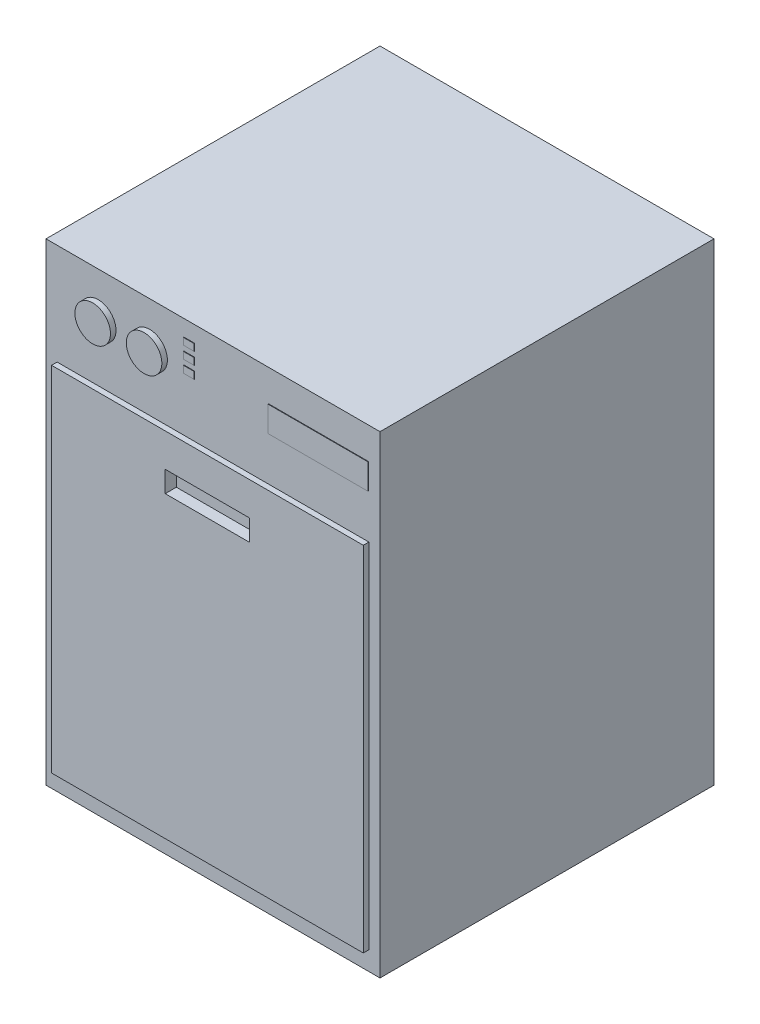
ISO-10303-21;
HEADER;
FILE_DESCRIPTION(('STEP AP214'),'2;1');
FILE_NAME('part.step','',(''),(''),'','','');
FILE_SCHEMA(('AUTOMOTIVE_DESIGN { 1 0 10303 214 1 1 1 1 }'));
ENDSEC;
DATA;
#1=APPLICATION_CONTEXT('core data for automotive mechanical design processes');
#2=APPLICATION_PROTOCOL_DEFINITION('international standard','automotive_design',2000,#1);
#3=PRODUCT_CONTEXT('',#1,'mechanical');
#4=PRODUCT('Part','Part','',(#3));
#5=PRODUCT_RELATED_PRODUCT_CATEGORY('part','',(#4));
#6=PRODUCT_DEFINITION_FORMATION('','',#4);
#7=PRODUCT_DEFINITION_CONTEXT('part definition',#1,'design');
#8=PRODUCT_DEFINITION('design','',#6,#7);
#9=PRODUCT_DEFINITION_SHAPE('','',#8);
#10=(LENGTH_UNIT() NAMED_UNIT(*) SI_UNIT(.MILLI.,.METRE.));
#11=(NAMED_UNIT(*) PLANE_ANGLE_UNIT() SI_UNIT($,.RADIAN.));
#12=(NAMED_UNIT(*) SI_UNIT($,.STERADIAN.) SOLID_ANGLE_UNIT());
#13=UNCERTAINTY_MEASURE_WITH_UNIT(LENGTH_MEASURE(1.E-05),#10,'distance_accuracy_value','');
#14=(GEOMETRIC_REPRESENTATION_CONTEXT(3) GLOBAL_UNCERTAINTY_ASSIGNED_CONTEXT((#13)) GLOBAL_UNIT_ASSIGNED_CONTEXT((#10,
#11,#12)) REPRESENTATION_CONTEXT('',''));
#15=CARTESIAN_POINT('',(0.,0.,0.));
#16=DIRECTION('',(0.,0.,1.));
#17=DIRECTION('',(1.,0.,0.));
#18=AXIS2_PLACEMENT_3D('',#15,#16,#17);
#19=CARTESIAN_POINT('',(300.,850.,300.));
#20=DIRECTION('',(0.,0.,-1.));
#21=DIRECTION('',(-1.,0.,0.));
#22=AXIS2_PLACEMENT_3D('',#19,#20,#21);
#23=PLANE('',#22);
#24=DIRECTION('',(0.,1.,0.));
#25=VECTOR('',#24,1.);
#26=CARTESIAN_POINT('',(-32.9059068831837,799.276803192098,300.));
#27=LINE('',#26,#25);
#28=CARTESIAN_POINT('',(-32.9059068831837,787.143832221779,300.));
#29=VERTEX_POINT('',#28);
#30=CARTESIAN_POINT('',(-32.9059068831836,799.276803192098,300.));
#31=VERTEX_POINT('',#30);
#32=EDGE_CURVE('E241',#29,#31,#27,.T.);
#33=ORIENTED_EDGE('',*,*,#32,.F.);
#34=DIRECTION('',(1.,0.,0.));
#35=VECTOR('',#34,1.);
#36=CARTESIAN_POINT('',(-52.3900308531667,787.143832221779,300.));
#37=LINE('',#36,#35);
#38=CARTESIAN_POINT('',(-52.3900308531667,787.143832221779,300.));
#39=VERTEX_POINT('',#38);
#40=EDGE_CURVE('E254',#39,#29,#37,.T.);
#41=ORIENTED_EDGE('',*,*,#40,.F.);
#42=DIRECTION('',(0.,-1.,0.));
#43=VECTOR('',#42,1.);
#44=CARTESIAN_POINT('',(-52.3900308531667,799.276803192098,300.));
#45=LINE('',#44,#43);
#46=CARTESIAN_POINT('',(-52.3900308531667,799.276803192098,300.));
#47=VERTEX_POINT('',#46);
#48=EDGE_CURVE('E263',#47,#39,#45,.T.);
#49=ORIENTED_EDGE('',*,*,#48,.F.);
#50=DIRECTION('',(-1.,0.,0.));
#51=VECTOR('',#50,1.);
#52=CARTESIAN_POINT('',(-52.3900308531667,799.276803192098,300.));
#53=LINE('',#52,#51);
#54=EDGE_CURVE('E244',#31,#47,#53,.T.);
#55=ORIENTED_EDGE('',*,*,#54,.F.);
#56=EDGE_LOOP('',(#33,#41,#49,#55));
#57=FACE_BOUND('',#56,.T.);
#58=DIRECTION('',(0.,-1.,0.));
#59=VECTOR('',#58,1.);
#60=CARTESIAN_POINT('',(100.043736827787,793.224876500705,300.));
#61=LINE('',#60,#59);
#62=CARTESIAN_POINT('',(100.043736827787,793.224876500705,300.));
#63=VERTEX_POINT('',#62);
#64=CARTESIAN_POINT('',(100.043736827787,747.453900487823,300.));
#65=VERTEX_POINT('',#64);
#66=EDGE_CURVE('E312',#63,#65,#61,.T.);
#67=ORIENTED_EDGE('',*,*,#66,.F.);
#68=DIRECTION('',(-1.,0.,0.));
#69=VECTOR('',#68,1.);
#70=CARTESIAN_POINT('',(279.273154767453,793.224876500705,300.));
#71=LINE('',#70,#69);
#72=CARTESIAN_POINT('',(279.273154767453,793.224876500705,300.));
#73=VERTEX_POINT('',#72);
#74=EDGE_CURVE('E317',#73,#63,#71,.T.);
#75=ORIENTED_EDGE('',*,*,#74,.F.);
#76=DIRECTION('',(0.,1.,0.));
#77=VECTOR('',#76,1.);
#78=CARTESIAN_POINT('',(279.273154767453,793.224876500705,300.));
#79=LINE('',#78,#77);
#80=CARTESIAN_POINT('',(279.273154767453,747.453900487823,300.));
#81=VERTEX_POINT('',#80);
#82=EDGE_CURVE('E329',#81,#73,#79,.T.);
#83=ORIENTED_EDGE('',*,*,#82,.F.);
#84=DIRECTION('',(1.,0.,0.));
#85=VECTOR('',#84,1.);
#86=CARTESIAN_POINT('',(279.273154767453,747.453900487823,300.));
#87=LINE('',#86,#85);
#88=EDGE_CURVE('E326',#65,#81,#87,.T.);
#89=ORIENTED_EDGE('',*,*,#88,.F.);
#90=EDGE_LOOP('',(#67,#75,#83,#89));
#91=FACE_BOUND('',#90,.T.);
#92=DIRECTION('',(1.,0.,0.));
#93=VECTOR('',#92,1.);
#94=CARTESIAN_POINT('',(300.,0.,300.));
#95=LINE('',#94,#93);
#96=CARTESIAN_POINT('',(-300.,0.,300.));
#97=VERTEX_POINT('',#96);
#98=CARTESIAN_POINT('',(300.,0.,300.));
#99=VERTEX_POINT('',#98);
#100=EDGE_CURVE('E430',#97,#99,#95,.T.);
#101=ORIENTED_EDGE('',*,*,#100,.T.);
#102=DIRECTION('',(0.,-1.,0.));
#103=VECTOR('',#102,1.);
#104=CARTESIAN_POINT('',(300.,850.,300.));
#105=LINE('',#104,#103);
#106=CARTESIAN_POINT('',(300.,850.,300.));
#107=VERTEX_POINT('',#106);
#108=EDGE_CURVE('E440',#107,#99,#105,.T.);
#109=ORIENTED_EDGE('',*,*,#108,.F.);
#110=DIRECTION('',(1.,0.,0.));
#111=VECTOR('',#110,1.);
#112=CARTESIAN_POINT('',(300.,850.,300.));
#113=LINE('',#112,#111);
#114=CARTESIAN_POINT('',(-300.,850.,300.));
#115=VERTEX_POINT('',#114);
#116=EDGE_CURVE('E420',#115,#107,#113,.T.);
#117=ORIENTED_EDGE('',*,*,#116,.F.);
#118=DIRECTION('',(0.,-1.,0.));
#119=VECTOR('',#118,1.);
#120=CARTESIAN_POINT('',(-300.,850.,300.));
#121=LINE('',#120,#119);
#122=EDGE_CURVE('E443',#115,#97,#121,.T.);
#123=ORIENTED_EDGE('',*,*,#122,.T.);
#124=EDGE_LOOP('',(#101,#109,#117,#123));
#125=FACE_BOUND('',#124,.T.);
#126=CARTESIAN_POINT('',(-206.205810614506,770.356504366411,300.));
#127=DIRECTION('',(0.,0.,-1.));
#128=DIRECTION('',(-1.,0.,0.));
#129=AXIS2_PLACEMENT_3D('',#126,#127,#128);
#130=CIRCLE('',#129,31.9295040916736);
#131=CARTESIAN_POINT('',(-238.135314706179,770.356504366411,300.));
#132=VERTEX_POINT('',#131);
#133=EDGE_CURVE('E43',#132,#132,#130,.F.);
#134=ORIENTED_EDGE('',*,*,#133,.F.);
#135=EDGE_LOOP('',(#134));
#136=FACE_BOUND('',#135,.T.);
#137=CARTESIAN_POINT('',(-113.843092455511,770.356504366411,300.));
#138=DIRECTION('',(0.,0.,-1.));
#139=DIRECTION('',(-1.,0.,0.));
#140=AXIS2_PLACEMENT_3D('',#137,#138,#139);
#141=CIRCLE('',#140,31.9295040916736);
#142=CARTESIAN_POINT('',(-145.772596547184,770.356504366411,300.));
#143=VERTEX_POINT('',#142);
#144=EDGE_CURVE('E11',#143,#143,#141,.F.);
#145=ORIENTED_EDGE('',*,*,#144,.F.);
#146=EDGE_LOOP('',(#145));
#147=FACE_BOUND('',#146,.T.);
#148=DIRECTION('',(0.,-1.,0.));
#149=VECTOR('',#148,1.);
#150=CARTESIAN_POINT('',(-280.,33.9126938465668,300.));
#151=LINE('',#150,#149);
#152=CARTESIAN_POINT('',(-280.,668.255873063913,300.));
#153=VERTEX_POINT('',#152);
#154=CARTESIAN_POINT('',(-280.,33.9126938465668,300.));
#155=VERTEX_POINT('',#154);
#156=EDGE_CURVE('E371',#153,#155,#151,.T.);
#157=ORIENTED_EDGE('',*,*,#156,.F.);
#158=DIRECTION('',(-1.,0.,0.));
#159=VECTOR('',#158,1.);
#160=CARTESIAN_POINT('',(-280.,668.255873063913,300.));
#161=LINE('',#160,#159);
#162=CARTESIAN_POINT('',(280.,668.255873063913,300.));
#163=VERTEX_POINT('',#162);
#164=EDGE_CURVE('E382',#163,#153,#161,.T.);
#165=ORIENTED_EDGE('',*,*,#164,.F.);
#166=DIRECTION('',(0.,1.,0.));
#167=VECTOR('',#166,1.);
#168=CARTESIAN_POINT('',(280.,33.9126938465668,300.));
#169=LINE('',#168,#167);
#170=CARTESIAN_POINT('',(280.,33.9126938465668,300.));
#171=VERTEX_POINT('',#170);
#172=EDGE_CURVE('E394',#171,#163,#169,.T.);
#173=ORIENTED_EDGE('',*,*,#172,.F.);
#174=DIRECTION('',(1.,0.,0.));
#175=VECTOR('',#174,1.);
#176=CARTESIAN_POINT('',(-280.,33.9126938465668,300.));
#177=LINE('',#176,#175);
#178=EDGE_CURVE('E391',#155,#171,#177,.T.);
#179=ORIENTED_EDGE('',*,*,#178,.F.);
#180=EDGE_LOOP('',(#157,#165,#173,#179));
#181=FACE_BOUND('',#180,.T.);
#182=DIRECTION('',(0.,1.,0.));
#183=VECTOR('',#182,1.);
#184=CARTESIAN_POINT('',(-32.9059068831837,821.009095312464,300.));
#185=LINE('',#184,#183);
#186=CARTESIAN_POINT('',(-32.9059068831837,808.947494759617,300.));
#187=VERTEX_POINT('',#186);
#188=CARTESIAN_POINT('',(-32.9059068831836,821.009095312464,300.));
#189=VERTEX_POINT('',#188);
#190=EDGE_CURVE('E279',#187,#189,#185,.T.);
#191=ORIENTED_EDGE('',*,*,#190,.F.);
#192=DIRECTION('',(1.,0.,0.));
#193=VECTOR('',#192,1.);
#194=CARTESIAN_POINT('',(-52.3900308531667,808.947494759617,300.));
#195=LINE('',#194,#193);
#196=CARTESIAN_POINT('',(-52.3900308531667,808.947494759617,300.));
#197=VERTEX_POINT('',#196);
#198=EDGE_CURVE('E284',#197,#187,#195,.T.);
#199=ORIENTED_EDGE('',*,*,#198,.F.);
#200=DIRECTION('',(0.,-1.,0.));
#201=VECTOR('',#200,1.);
#202=CARTESIAN_POINT('',(-52.3900308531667,821.009095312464,300.));
#203=LINE('',#202,#201);
#204=CARTESIAN_POINT('',(-52.3900308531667,821.009095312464,300.));
#205=VERTEX_POINT('',#204);
#206=EDGE_CURVE('E296',#205,#197,#203,.T.);
#207=ORIENTED_EDGE('',*,*,#206,.F.);
#208=DIRECTION('',(-1.,0.,0.));
#209=VECTOR('',#208,1.);
#210=CARTESIAN_POINT('',(-52.3900308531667,821.009095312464,300.));
#211=LINE('',#210,#209);
#212=EDGE_CURVE('E293',#189,#205,#211,.T.);
#213=ORIENTED_EDGE('',*,*,#212,.F.);
#214=EDGE_LOOP('',(#191,#199,#207,#213));
#215=FACE_BOUND('',#214,.T.);
#216=DIRECTION('',(0.,1.,0.));
#217=VECTOR('',#216,1.);
#218=CARTESIAN_POINT('',(-32.9059068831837,777.658283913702,300.));
#219=LINE('',#218,#217);
#220=CARTESIAN_POINT('',(-32.9059068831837,765.340169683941,300.));
#221=VERTEX_POINT('',#220);
#222=CARTESIAN_POINT('',(-32.9059068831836,777.658283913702,300.));
#223=VERTEX_POINT('',#222);
#224=EDGE_CURVE('E240',#221,#223,#219,.T.);
#225=ORIENTED_EDGE('',*,*,#224,.F.);
#226=DIRECTION('',(1.,0.,0.));
#227=VECTOR('',#226,1.);
#228=CARTESIAN_POINT('',(-52.3900308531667,765.340169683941,300.));
#229=LINE('',#228,#227);
#230=CARTESIAN_POINT('',(-52.3900308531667,765.340169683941,300.));
#231=VERTEX_POINT('',#230);
#232=EDGE_CURVE('E237',#231,#221,#229,.T.);
#233=ORIENTED_EDGE('',*,*,#232,.F.);
#234=DIRECTION('',(0.,-1.,0.));
#235=VECTOR('',#234,1.);
#236=CARTESIAN_POINT('',(-52.3900308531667,777.658283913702,300.));
#237=LINE('',#236,#235);
#238=CARTESIAN_POINT('',(-52.3900308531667,777.658283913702,300.));
#239=VERTEX_POINT('',#238);
#240=EDGE_CURVE('E55',#239,#231,#237,.T.);
#241=ORIENTED_EDGE('',*,*,#240,.F.);
#242=DIRECTION('',(-1.,0.,0.));
#243=VECTOR('',#242,1.);
#244=CARTESIAN_POINT('',(-52.3900308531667,777.658283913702,300.));
#245=LINE('',#244,#243);
#246=EDGE_CURVE('E50',#223,#239,#245,.T.);
#247=ORIENTED_EDGE('',*,*,#246,.F.);
#248=EDGE_LOOP('',(#225,#233,#241,#247));
#249=FACE_BOUND('',#248,.T.);
#250=ADVANCED_FACE('F35',(#57,#91,#125,#136,#147,#181,#215,#249),#23,.F.);
#251=CARTESIAN_POINT('',(-300.,850.,300.));
#252=DIRECTION('',(1.,0.,0.));
#253=DIRECTION('',(0.,0.,-1.));
#254=AXIS2_PLACEMENT_3D('',#251,#252,#253);
#255=PLANE('',#254);
#256=DIRECTION('',(0.,0.,1.));
#257=VECTOR('',#256,1.);
#258=CARTESIAN_POINT('',(-300.,0.,300.));
#259=LINE('',#258,#257);
#260=CARTESIAN_POINT('',(-300.,0.,-300.));
#261=VERTEX_POINT('',#260);
#262=EDGE_CURVE('E416',#261,#97,#259,.T.);
#263=ORIENTED_EDGE('',*,*,#262,.T.);
#264=ORIENTED_EDGE('',*,*,#122,.F.);
#265=DIRECTION('',(0.,0.,1.));
#266=VECTOR('',#265,1.);
#267=CARTESIAN_POINT('',(-300.,850.,300.));
#268=LINE('',#267,#266);
#269=CARTESIAN_POINT('',(-300.,850.,-300.));
#270=VERTEX_POINT('',#269);
#271=EDGE_CURVE('E417',#270,#115,#268,.T.);
#272=ORIENTED_EDGE('',*,*,#271,.F.);
#273=DIRECTION('',(0.,-1.,0.));
#274=VECTOR('',#273,1.);
#275=CARTESIAN_POINT('',(-300.,850.,-300.));
#276=LINE('',#275,#274);
#277=EDGE_CURVE('E427',#270,#261,#276,.T.);
#278=ORIENTED_EDGE('',*,*,#277,.T.);
#279=EDGE_LOOP('',(#263,#264,#272,#278));
#280=FACE_BOUND('',#279,.T.);
#281=ADVANCED_FACE('F37',(#280),#255,.F.);
#282=CARTESIAN_POINT('',(300.,850.,300.));
#283=DIRECTION('',(-1.,0.,0.));
#284=DIRECTION('',(0.,0.,1.));
#285=AXIS2_PLACEMENT_3D('',#282,#283,#284);
#286=PLANE('',#285);
#287=DIRECTION('',(0.,0.,-1.));
#288=VECTOR('',#287,1.);
#289=CARTESIAN_POINT('',(300.,0.,300.));
#290=LINE('',#289,#288);
#291=CARTESIAN_POINT('',(300.,0.,-300.));
#292=VERTEX_POINT('',#291);
#293=EDGE_CURVE('E432',#99,#292,#290,.T.);
#294=ORIENTED_EDGE('',*,*,#293,.T.);
#295=DIRECTION('',(0.,-1.,0.));
#296=VECTOR('',#295,1.);
#297=CARTESIAN_POINT('',(300.,850.,-300.));
#298=LINE('',#297,#296);
#299=CARTESIAN_POINT('',(300.,850.,-300.));
#300=VERTEX_POINT('',#299);
#301=EDGE_CURVE('E437',#300,#292,#298,.T.);
#302=ORIENTED_EDGE('',*,*,#301,.F.);
#303=DIRECTION('',(0.,0.,-1.));
#304=VECTOR('',#303,1.);
#305=CARTESIAN_POINT('',(300.,850.,300.));
#306=LINE('',#305,#304);
#307=EDGE_CURVE('E423',#107,#300,#306,.T.);
#308=ORIENTED_EDGE('',*,*,#307,.F.);
#309=ORIENTED_EDGE('',*,*,#108,.T.);
#310=EDGE_LOOP('',(#294,#302,#308,#309));
#311=FACE_BOUND('',#310,.T.);
#312=ADVANCED_FACE('F609',(#311),#286,.F.);
#313=CARTESIAN_POINT('',(300.,850.,-300.));
#314=DIRECTION('',(0.,0.,1.));
#315=DIRECTION('',(1.,0.,0.));
#316=AXIS2_PLACEMENT_3D('',#313,#314,#315);
#317=PLANE('',#316);
#318=DIRECTION('',(-1.,0.,0.));
#319=VECTOR('',#318,1.);
#320=CARTESIAN_POINT('',(300.,0.,-300.));
#321=LINE('',#320,#319);
#322=EDGE_CURVE('E421',#292,#261,#321,.T.);
#323=ORIENTED_EDGE('',*,*,#322,.T.);
#324=ORIENTED_EDGE('',*,*,#277,.F.);
#325=DIRECTION('',(-1.,0.,0.));
#326=VECTOR('',#325,1.);
#327=CARTESIAN_POINT('',(300.,850.,-300.));
#328=LINE('',#327,#326);
#329=EDGE_CURVE('E425',#300,#270,#328,.T.);
#330=ORIENTED_EDGE('',*,*,#329,.F.);
#331=ORIENTED_EDGE('',*,*,#301,.T.);
#332=EDGE_LOOP('',(#323,#324,#330,#331));
#333=FACE_BOUND('',#332,.T.);
#334=ADVANCED_FACE('F602',(#333),#317,.F.);
#335=CARTESIAN_POINT('',(0.,850.,0.));
#336=DIRECTION('',(0.,1.,0.));
#337=DIRECTION('',(0.,0.,1.));
#338=AXIS2_PLACEMENT_3D('',#335,#336,#337);
#339=PLANE('',#338);
#340=ORIENTED_EDGE('',*,*,#271,.T.);
#341=ORIENTED_EDGE('',*,*,#116,.T.);
#342=ORIENTED_EDGE('',*,*,#307,.T.);
#343=ORIENTED_EDGE('',*,*,#329,.T.);
#344=EDGE_LOOP('',(#340,#341,#342,#343));
#345=FACE_BOUND('',#344,.T.);
#346=ADVANCED_FACE('F599',(#345),#339,.T.);
#347=CARTESIAN_POINT('',(0.,0.,0.));
#348=DIRECTION('',(0.,1.,0.));
#349=DIRECTION('',(0.,0.,1.));
#350=AXIS2_PLACEMENT_3D('',#347,#348,#349);
#351=PLANE('',#350);
#352=ORIENTED_EDGE('',*,*,#262,.F.);
#353=ORIENTED_EDGE('',*,*,#322,.F.);
#354=ORIENTED_EDGE('',*,*,#293,.F.);
#355=ORIENTED_EDGE('',*,*,#100,.F.);
#356=EDGE_LOOP('',(#352,#353,#354,#355));
#357=FACE_BOUND('',#356,.T.);
#358=ADVANCED_FACE('F597',(#357),#351,.F.);
#359=CARTESIAN_POINT('',(-206.205810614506,770.356504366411,310.));
#360=DIRECTION('',(0.,0.,-1.));
#361=DIRECTION('',(-1.,0.,0.));
#362=AXIS2_PLACEMENT_3D('',#359,#360,#361);
#363=CYLINDRICAL_SURFACE('',#362,31.9295040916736);
#364=CARTESIAN_POINT('',(-206.205810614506,770.356504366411,310.));
#365=DIRECTION('',(0.,0.,1.));
#366=DIRECTION('',(1.,0.,0.));
#367=AXIS2_PLACEMENT_3D('',#364,#365,#366);
#368=CIRCLE('',#367,31.9295040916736);
#369=CARTESIAN_POINT('',(-174.276306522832,770.356504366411,310.));
#370=VERTEX_POINT('',#369);
#371=EDGE_CURVE('E413',#370,#370,#368,.T.);
#372=ORIENTED_EDGE('',*,*,#371,.F.);
#373=EDGE_LOOP('',(#372));
#374=FACE_BOUND('',#373,.T.);
#375=ORIENTED_EDGE('',*,*,#133,.T.);
#376=EDGE_LOOP('',(#375));
#377=FACE_BOUND('',#376,.T.);
#378=ADVANCED_FACE('F448',(#374,#377),#363,.T.);
#379=CARTESIAN_POINT('',(-206.205810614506,770.356504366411,310.));
#380=DIRECTION('',(0.,0.,1.));
#381=DIRECTION('',(1.,0.,0.));
#382=AXIS2_PLACEMENT_3D('',#379,#380,#381);
#383=PLANE('',#382);
#384=ORIENTED_EDGE('',*,*,#371,.T.);
#385=EDGE_LOOP('',(#384));
#386=FACE_BOUND('',#385,.T.);
#387=ADVANCED_FACE('F590',(#386),#383,.T.);
#388=CARTESIAN_POINT('',(-113.843092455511,770.356504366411,310.));
#389=DIRECTION('',(0.,0.,-1.));
#390=DIRECTION('',(-1.,0.,0.));
#391=AXIS2_PLACEMENT_3D('',#388,#389,#390);
#392=CYLINDRICAL_SURFACE('',#391,31.9295040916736);
#393=CARTESIAN_POINT('',(-113.843092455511,770.356504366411,310.));
#394=DIRECTION('',(0.,0.,1.));
#395=DIRECTION('',(1.,0.,0.));
#396=AXIS2_PLACEMENT_3D('',#393,#394,#395);
#397=CIRCLE('',#396,31.9295040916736);
#398=CARTESIAN_POINT('',(-81.9135883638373,770.356504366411,310.));
#399=VERTEX_POINT('',#398);
#400=EDGE_CURVE('E410',#399,#399,#397,.T.);
#401=ORIENTED_EDGE('',*,*,#400,.F.);
#402=EDGE_LOOP('',(#401));
#403=FACE_BOUND('',#402,.T.);
#404=ORIENTED_EDGE('',*,*,#144,.T.);
#405=EDGE_LOOP('',(#404));
#406=FACE_BOUND('',#405,.T.);
#407=ADVANCED_FACE('F586',(#403,#406),#392,.T.);
#408=CARTESIAN_POINT('',(-113.843092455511,770.356504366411,310.));
#409=DIRECTION('',(0.,0.,1.));
#410=DIRECTION('',(1.,0.,0.));
#411=AXIS2_PLACEMENT_3D('',#408,#409,#410);
#412=PLANE('',#411);
#413=ORIENTED_EDGE('',*,*,#400,.T.);
#414=EDGE_LOOP('',(#413));
#415=FACE_BOUND('',#414,.T.);
#416=ADVANCED_FACE('F582',(#415),#412,.T.);
#417=CARTESIAN_POINT('',(-280.,33.9126938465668,310.));
#418=DIRECTION('',(1.,0.,0.));
#419=DIRECTION('',(0.,0.,-1.));
#420=AXIS2_PLACEMENT_3D('',#417,#418,#419);
#421=PLANE('',#420);
#422=ORIENTED_EDGE('',*,*,#156,.T.);
#423=DIRECTION('',(0.,0.,-1.));
#424=VECTOR('',#423,1.);
#425=CARTESIAN_POINT('',(-280.,33.9126938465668,310.));
#426=LINE('',#425,#424);
#427=CARTESIAN_POINT('',(-280.,33.9126938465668,310.));
#428=VERTEX_POINT('',#427);
#429=EDGE_CURVE('E407',#428,#155,#426,.T.);
#430=ORIENTED_EDGE('',*,*,#429,.F.);
#431=DIRECTION('',(0.,-1.,0.));
#432=VECTOR('',#431,1.);
#433=CARTESIAN_POINT('',(-280.,33.9126938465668,310.));
#434=LINE('',#433,#432);
#435=CARTESIAN_POINT('',(-280.,668.255873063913,310.));
#436=VERTEX_POINT('',#435);
#437=EDGE_CURVE('E378',#436,#428,#434,.T.);
#438=ORIENTED_EDGE('',*,*,#437,.F.);
#439=DIRECTION('',(0.,0.,-1.));
#440=VECTOR('',#439,1.);
#441=CARTESIAN_POINT('',(-280.,668.255873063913,310.));
#442=LINE('',#441,#440);
#443=EDGE_CURVE('E388',#436,#153,#442,.T.);
#444=ORIENTED_EDGE('',*,*,#443,.T.);
#445=EDGE_LOOP('',(#422,#430,#438,#444));
#446=FACE_BOUND('',#445,.T.);
#447=ADVANCED_FACE('F578',(#446),#421,.F.);
#448=CARTESIAN_POINT('',(-280.,33.9126938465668,310.));
#449=DIRECTION('',(0.,1.,0.));
#450=DIRECTION('',(0.,0.,1.));
#451=AXIS2_PLACEMENT_3D('',#448,#449,#450);
#452=PLANE('',#451);
#453=ORIENTED_EDGE('',*,*,#178,.T.);
#454=DIRECTION('',(0.,0.,-1.));
#455=VECTOR('',#454,1.);
#456=CARTESIAN_POINT('',(280.,33.9126938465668,310.));
#457=LINE('',#456,#455);
#458=CARTESIAN_POINT('',(280.,33.9126938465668,310.));
#459=VERTEX_POINT('',#458);
#460=EDGE_CURVE('E404',#459,#171,#457,.T.);
#461=ORIENTED_EDGE('',*,*,#460,.F.);
#462=DIRECTION('',(1.,0.,0.));
#463=VECTOR('',#462,1.);
#464=CARTESIAN_POINT('',(-280.,33.9126938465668,310.));
#465=LINE('',#464,#463);
#466=EDGE_CURVE('E381',#428,#459,#465,.T.);
#467=ORIENTED_EDGE('',*,*,#466,.F.);
#468=ORIENTED_EDGE('',*,*,#429,.T.);
#469=EDGE_LOOP('',(#453,#461,#467,#468));
#470=FACE_BOUND('',#469,.T.);
#471=ADVANCED_FACE('F574',(#470),#452,.F.);
#472=CARTESIAN_POINT('',(280.,33.9126938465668,310.));
#473=DIRECTION('',(-1.,0.,0.));
#474=DIRECTION('',(0.,0.,1.));
#475=AXIS2_PLACEMENT_3D('',#472,#473,#474);
#476=PLANE('',#475);
#477=ORIENTED_EDGE('',*,*,#172,.T.);
#478=DIRECTION('',(0.,0.,-1.));
#479=VECTOR('',#478,1.);
#480=CARTESIAN_POINT('',(280.,668.255873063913,310.));
#481=LINE('',#480,#479);
#482=CARTESIAN_POINT('',(280.,668.255873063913,310.));
#483=VERTEX_POINT('',#482);
#484=EDGE_CURVE('E401',#483,#163,#481,.T.);
#485=ORIENTED_EDGE('',*,*,#484,.F.);
#486=DIRECTION('',(0.,1.,0.));
#487=VECTOR('',#486,1.);
#488=CARTESIAN_POINT('',(280.,33.9126938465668,310.));
#489=LINE('',#488,#487);
#490=EDGE_CURVE('E384',#459,#483,#489,.T.);
#491=ORIENTED_EDGE('',*,*,#490,.F.);
#492=ORIENTED_EDGE('',*,*,#460,.T.);
#493=EDGE_LOOP('',(#477,#485,#491,#492));
#494=FACE_BOUND('',#493,.T.);
#495=ADVANCED_FACE('F570',(#494),#476,.F.);
#496=CARTESIAN_POINT('',(-280.,668.255873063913,310.));
#497=DIRECTION('',(0.,-1.,0.));
#498=DIRECTION('',(0.,0.,-1.));
#499=AXIS2_PLACEMENT_3D('',#496,#497,#498);
#500=PLANE('',#499);
#501=ORIENTED_EDGE('',*,*,#164,.T.);
#502=ORIENTED_EDGE('',*,*,#443,.F.);
#503=DIRECTION('',(-1.,0.,0.));
#504=VECTOR('',#503,1.);
#505=CARTESIAN_POINT('',(-280.,668.255873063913,310.));
#506=LINE('',#505,#504);
#507=EDGE_CURVE('E386',#483,#436,#506,.T.);
#508=ORIENTED_EDGE('',*,*,#507,.F.);
#509=ORIENTED_EDGE('',*,*,#484,.T.);
#510=EDGE_LOOP('',(#501,#502,#508,#509));
#511=FACE_BOUND('',#510,.T.);
#512=ADVANCED_FACE('F566',(#511),#500,.F.);
#513=CARTESIAN_POINT('',(0.,0.,310.));
#514=DIRECTION('',(0.,0.,-1.));
#515=DIRECTION('',(-1.,0.,0.));
#516=AXIS2_PLACEMENT_3D('',#513,#514,#515);
#517=PLANE('',#516);
#518=DIRECTION('',(1.,0.,0.));
#519=VECTOR('',#518,1.);
#520=CARTESIAN_POINT('',(75.8261397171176,570.620654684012,310.));
#521=LINE('',#520,#519);
#522=CARTESIAN_POINT('',(-75.8261397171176,570.620654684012,310.));
#523=VERTEX_POINT('',#522);
#524=CARTESIAN_POINT('',(75.8261397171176,570.620654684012,310.));
#525=VERTEX_POINT('',#524);
#526=EDGE_CURVE('E361',#523,#525,#521,.T.);
#527=ORIENTED_EDGE('',*,*,#526,.F.);
#528=DIRECTION('',(0.,-1.,0.));
#529=VECTOR('',#528,1.);
#530=CARTESIAN_POINT('',(-75.8261397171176,570.620654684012,310.));
#531=LINE('',#530,#529);
#532=CARTESIAN_POINT('',(-75.8261397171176,608.533724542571,310.));
#533=VERTEX_POINT('',#532);
#534=EDGE_CURVE('E345',#533,#523,#531,.T.);
#535=ORIENTED_EDGE('',*,*,#534,.F.);
#536=DIRECTION('',(-1.,0.,0.));
#537=VECTOR('',#536,1.);
#538=CARTESIAN_POINT('',(75.8261397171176,608.533724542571,310.));
#539=LINE('',#538,#537);
#540=CARTESIAN_POINT('',(75.8261397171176,608.533724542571,310.));
#541=VERTEX_POINT('',#540);
#542=EDGE_CURVE('E350',#541,#533,#539,.T.);
#543=ORIENTED_EDGE('',*,*,#542,.F.);
#544=DIRECTION('',(0.,1.,0.));
#545=VECTOR('',#544,1.);
#546=CARTESIAN_POINT('',(75.8261397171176,570.620654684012,310.));
#547=LINE('',#546,#545);
#548=EDGE_CURVE('E364',#525,#541,#547,.T.);
#549=ORIENTED_EDGE('',*,*,#548,.F.);
#550=EDGE_LOOP('',(#527,#535,#543,#549));
#551=FACE_BOUND('',#550,.T.);
#552=ORIENTED_EDGE('',*,*,#437,.T.);
#553=ORIENTED_EDGE('',*,*,#466,.T.);
#554=ORIENTED_EDGE('',*,*,#490,.T.);
#555=ORIENTED_EDGE('',*,*,#507,.T.);
#556=EDGE_LOOP('',(#552,#553,#554,#555));
#557=FACE_BOUND('',#556,.T.);
#558=ADVANCED_FACE('F562',(#551,#557),#517,.F.);
#559=CARTESIAN_POINT('',(-75.8261397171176,570.620654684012,290.));
#560=DIRECTION('',(-1.,0.,0.));
#561=DIRECTION('',(0.,0.,1.));
#562=AXIS2_PLACEMENT_3D('',#559,#560,#561);
#563=PLANE('',#562);
#564=ORIENTED_EDGE('',*,*,#534,.T.);
#565=DIRECTION('',(0.,0.,1.));
#566=VECTOR('',#565,1.);
#567=CARTESIAN_POINT('',(-75.8261397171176,570.620654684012,290.));
#568=LINE('',#567,#566);
#569=CARTESIAN_POINT('',(-75.8261397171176,570.620654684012,290.));
#570=VERTEX_POINT('',#569);
#571=EDGE_CURVE('E359',#570,#523,#568,.T.);
#572=ORIENTED_EDGE('',*,*,#571,.F.);
#573=DIRECTION('',(0.,-1.,0.));
#574=VECTOR('',#573,1.);
#575=CARTESIAN_POINT('',(-75.8261397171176,570.620654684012,290.));
#576=LINE('',#575,#574);
#577=CARTESIAN_POINT('',(-75.8261397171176,608.533724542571,290.));
#578=VERTEX_POINT('',#577);
#579=EDGE_CURVE('E346',#578,#570,#576,.T.);
#580=ORIENTED_EDGE('',*,*,#579,.F.);
#581=DIRECTION('',(0.,0.,1.));
#582=VECTOR('',#581,1.);
#583=CARTESIAN_POINT('',(-75.8261397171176,608.533724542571,290.));
#584=LINE('',#583,#582);
#585=EDGE_CURVE('E369',#578,#533,#584,.T.);
#586=ORIENTED_EDGE('',*,*,#585,.T.);
#587=EDGE_LOOP('',(#564,#572,#580,#586));
#588=FACE_BOUND('',#587,.T.);
#589=ADVANCED_FACE('F552',(#588),#563,.F.);
#590=CARTESIAN_POINT('',(75.8261397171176,608.533724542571,290.));
#591=DIRECTION('',(0.,1.,0.));
#592=DIRECTION('',(0.,0.,1.));
#593=AXIS2_PLACEMENT_3D('',#590,#591,#592);
#594=PLANE('',#593);
#595=ORIENTED_EDGE('',*,*,#542,.T.);
#596=ORIENTED_EDGE('',*,*,#585,.F.);
#597=DIRECTION('',(-1.,0.,0.));
#598=VECTOR('',#597,1.);
#599=CARTESIAN_POINT('',(75.8261397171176,608.533724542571,290.));
#600=LINE('',#599,#598);
#601=CARTESIAN_POINT('',(75.8261397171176,608.533724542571,290.));
#602=VERTEX_POINT('',#601);
#603=EDGE_CURVE('E356',#602,#578,#600,.T.);
#604=ORIENTED_EDGE('',*,*,#603,.F.);
#605=DIRECTION('',(0.,0.,1.));
#606=VECTOR('',#605,1.);
#607=CARTESIAN_POINT('',(75.8261397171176,608.533724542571,290.));
#608=LINE('',#607,#606);
#609=EDGE_CURVE('E372',#602,#541,#608,.T.);
#610=ORIENTED_EDGE('',*,*,#609,.T.);
#611=EDGE_LOOP('',(#595,#596,#604,#610));
#612=FACE_BOUND('',#611,.T.);
#613=ADVANCED_FACE('F548',(#612),#594,.F.);
#614=CARTESIAN_POINT('',(75.8261397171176,570.620654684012,290.));
#615=DIRECTION('',(1.,0.,0.));
#616=DIRECTION('',(0.,0.,-1.));
#617=AXIS2_PLACEMENT_3D('',#614,#615,#616);
#618=PLANE('',#617);
#619=ORIENTED_EDGE('',*,*,#548,.T.);
#620=ORIENTED_EDGE('',*,*,#609,.F.);
#621=DIRECTION('',(0.,1.,0.));
#622=VECTOR('',#621,1.);
#623=CARTESIAN_POINT('',(75.8261397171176,570.620654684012,290.));
#624=LINE('',#623,#622);
#625=CARTESIAN_POINT('',(75.8261397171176,570.620654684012,290.));
#626=VERTEX_POINT('',#625);
#627=EDGE_CURVE('E353',#626,#602,#624,.T.);
#628=ORIENTED_EDGE('',*,*,#627,.F.);
#629=DIRECTION('',(0.,0.,1.));
#630=VECTOR('',#629,1.);
#631=CARTESIAN_POINT('',(75.8261397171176,570.620654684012,290.));
#632=LINE('',#631,#630);
#633=EDGE_CURVE('E374',#626,#525,#632,.T.);
#634=ORIENTED_EDGE('',*,*,#633,.T.);
#635=EDGE_LOOP('',(#619,#620,#628,#634));
#636=FACE_BOUND('',#635,.T.);
#637=ADVANCED_FACE('F551',(#636),#618,.F.);
#638=CARTESIAN_POINT('',(75.8261397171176,570.620654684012,290.));
#639=DIRECTION('',(0.,-1.,0.));
#640=DIRECTION('',(0.,0.,-1.));
#641=AXIS2_PLACEMENT_3D('',#638,#639,#640);
#642=PLANE('',#641);
#643=ORIENTED_EDGE('',*,*,#526,.T.);
#644=ORIENTED_EDGE('',*,*,#633,.F.);
#645=DIRECTION('',(1.,0.,0.));
#646=VECTOR('',#645,1.);
#647=CARTESIAN_POINT('',(75.8261397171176,570.620654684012,290.));
#648=LINE('',#647,#646);
#649=EDGE_CURVE('E349',#570,#626,#648,.T.);
#650=ORIENTED_EDGE('',*,*,#649,.F.);
#651=ORIENTED_EDGE('',*,*,#571,.T.);
#652=EDGE_LOOP('',(#643,#644,#650,#651));
#653=FACE_BOUND('',#652,.T.);
#654=ADVANCED_FACE('F546',(#653),#642,.F.);
#655=CARTESIAN_POINT('',(0.,0.,290.));
#656=DIRECTION('',(0.,0.,1.));
#657=DIRECTION('',(1.,0.,0.));
#658=AXIS2_PLACEMENT_3D('',#655,#656,#657);
#659=PLANE('',#658);
#660=ORIENTED_EDGE('',*,*,#579,.T.);
#661=ORIENTED_EDGE('',*,*,#649,.T.);
#662=ORIENTED_EDGE('',*,*,#627,.T.);
#663=ORIENTED_EDGE('',*,*,#603,.T.);
#664=EDGE_LOOP('',(#660,#661,#662,#663));
#665=FACE_BOUND('',#664,.T.);
#666=ADVANCED_FACE('F542',(#665),#659,.T.);
#667=CARTESIAN_POINT('',(100.043736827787,793.224876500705,301.));
#668=DIRECTION('',(1.,0.,0.));
#669=DIRECTION('',(0.,0.,-1.));
#670=AXIS2_PLACEMENT_3D('',#667,#668,#669);
#671=PLANE('',#670);
#672=ORIENTED_EDGE('',*,*,#66,.T.);
#673=DIRECTION('',(0.,0.,-1.));
#674=VECTOR('',#673,1.);
#675=CARTESIAN_POINT('',(100.043736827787,747.453900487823,301.));
#676=LINE('',#675,#674);
#677=CARTESIAN_POINT('',(100.043736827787,747.453900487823,301.));
#678=VERTEX_POINT('',#677);
#679=EDGE_CURVE('E342',#678,#65,#676,.T.);
#680=ORIENTED_EDGE('',*,*,#679,.F.);
#681=DIRECTION('',(0.,-1.,0.));
#682=VECTOR('',#681,1.);
#683=CARTESIAN_POINT('',(100.043736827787,793.224876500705,301.));
#684=LINE('',#683,#682);
#685=CARTESIAN_POINT('',(100.043736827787,793.224876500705,301.));
#686=VERTEX_POINT('',#685);
#687=EDGE_CURVE('E313',#686,#678,#684,.T.);
#688=ORIENTED_EDGE('',*,*,#687,.F.);
#689=DIRECTION('',(0.,0.,-1.));
#690=VECTOR('',#689,1.);
#691=CARTESIAN_POINT('',(100.043736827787,793.224876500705,301.));
#692=LINE('',#691,#690);
#693=EDGE_CURVE('E323',#686,#63,#692,.T.);
#694=ORIENTED_EDGE('',*,*,#693,.T.);
#695=EDGE_LOOP('',(#672,#680,#688,#694));
#696=FACE_BOUND('',#695,.T.);
#697=ADVANCED_FACE('F538',(#696),#671,.F.);
#698=CARTESIAN_POINT('',(279.273154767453,747.453900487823,301.));
#699=DIRECTION('',(0.,1.,0.));
#700=DIRECTION('',(0.,0.,1.));
#701=AXIS2_PLACEMENT_3D('',#698,#699,#700);
#702=PLANE('',#701);
#703=ORIENTED_EDGE('',*,*,#88,.T.);
#704=DIRECTION('',(0.,0.,-1.));
#705=VECTOR('',#704,1.);
#706=CARTESIAN_POINT('',(279.273154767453,747.453900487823,301.));
#707=LINE('',#706,#705);
#708=CARTESIAN_POINT('',(279.273154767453,747.453900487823,301.));
#709=VERTEX_POINT('',#708);
#710=EDGE_CURVE('E339',#709,#81,#707,.T.);
#711=ORIENTED_EDGE('',*,*,#710,.F.);
#712=DIRECTION('',(1.,0.,0.));
#713=VECTOR('',#712,1.);
#714=CARTESIAN_POINT('',(279.273154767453,747.453900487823,301.));
#715=LINE('',#714,#713);
#716=EDGE_CURVE('E316',#678,#709,#715,.T.);
#717=ORIENTED_EDGE('',*,*,#716,.F.);
#718=ORIENTED_EDGE('',*,*,#679,.T.);
#719=EDGE_LOOP('',(#703,#711,#717,#718));
#720=FACE_BOUND('',#719,.T.);
#721=ADVANCED_FACE('F534',(#720),#702,.F.);
#722=CARTESIAN_POINT('',(279.273154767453,793.224876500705,301.));
#723=DIRECTION('',(-1.,0.,0.));
#724=DIRECTION('',(0.,0.,1.));
#725=AXIS2_PLACEMENT_3D('',#722,#723,#724);
#726=PLANE('',#725);
#727=ORIENTED_EDGE('',*,*,#82,.T.);
#728=DIRECTION('',(0.,0.,-1.));
#729=VECTOR('',#728,1.);
#730=CARTESIAN_POINT('',(279.273154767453,793.224876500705,301.));
#731=LINE('',#730,#729);
#732=CARTESIAN_POINT('',(279.273154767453,793.224876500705,301.));
#733=VERTEX_POINT('',#732);
#734=EDGE_CURVE('E336',#733,#73,#731,.T.);
#735=ORIENTED_EDGE('',*,*,#734,.F.);
#736=DIRECTION('',(0.,1.,0.));
#737=VECTOR('',#736,1.);
#738=CARTESIAN_POINT('',(279.273154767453,793.224876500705,301.));
#739=LINE('',#738,#737);
#740=EDGE_CURVE('E319',#709,#733,#739,.T.);
#741=ORIENTED_EDGE('',*,*,#740,.F.);
#742=ORIENTED_EDGE('',*,*,#710,.T.);
#743=EDGE_LOOP('',(#727,#735,#741,#742));
#744=FACE_BOUND('',#743,.T.);
#745=ADVANCED_FACE('F530',(#744),#726,.F.);
#746=CARTESIAN_POINT('',(279.273154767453,793.224876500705,301.));
#747=DIRECTION('',(0.,-1.,0.));
#748=DIRECTION('',(0.,0.,-1.));
#749=AXIS2_PLACEMENT_3D('',#746,#747,#748);
#750=PLANE('',#749);
#751=ORIENTED_EDGE('',*,*,#74,.T.);
#752=ORIENTED_EDGE('',*,*,#693,.F.);
#753=DIRECTION('',(-1.,0.,0.));
#754=VECTOR('',#753,1.);
#755=CARTESIAN_POINT('',(279.273154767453,793.224876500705,301.));
#756=LINE('',#755,#754);
#757=EDGE_CURVE('E321',#733,#686,#756,.T.);
#758=ORIENTED_EDGE('',*,*,#757,.F.);
#759=ORIENTED_EDGE('',*,*,#734,.T.);
#760=EDGE_LOOP('',(#751,#752,#758,#759));
#761=FACE_BOUND('',#760,.T.);
#762=ADVANCED_FACE('F526',(#761),#750,.F.);
#763=CARTESIAN_POINT('',(0.,0.,301.));
#764=DIRECTION('',(0.,0.,-1.));
#765=DIRECTION('',(-1.,0.,0.));
#766=AXIS2_PLACEMENT_3D('',#763,#764,#765);
#767=PLANE('',#766);
#768=ORIENTED_EDGE('',*,*,#687,.T.);
#769=ORIENTED_EDGE('',*,*,#716,.T.);
#770=ORIENTED_EDGE('',*,*,#740,.T.);
#771=ORIENTED_EDGE('',*,*,#757,.T.);
#772=EDGE_LOOP('',(#768,#769,#770,#771));
#773=FACE_BOUND('',#772,.T.);
#774=ADVANCED_FACE('F522',(#773),#767,.F.);
#775=CARTESIAN_POINT('',(-32.9059068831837,821.009095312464,301.));
#776=DIRECTION('',(-1.,0.,0.));
#777=DIRECTION('',(0.,0.,1.));
#778=AXIS2_PLACEMENT_3D('',#775,#776,#777);
#779=PLANE('',#778);
#780=ORIENTED_EDGE('',*,*,#190,.T.);
#781=DIRECTION('',(0.,0.,-1.));
#782=VECTOR('',#781,1.);
#783=CARTESIAN_POINT('',(-32.9059068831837,821.009095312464,301.));
#784=LINE('',#783,#782);
#785=CARTESIAN_POINT('',(-32.9059068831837,821.009095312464,301.));
#786=VERTEX_POINT('',#785);
#787=EDGE_CURVE('E309',#786,#189,#784,.T.);
#788=ORIENTED_EDGE('',*,*,#787,.F.);
#789=DIRECTION('',(0.,1.,0.));
#790=VECTOR('',#789,1.);
#791=CARTESIAN_POINT('',(-32.9059068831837,821.009095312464,301.));
#792=LINE('',#791,#790);
#793=CARTESIAN_POINT('',(-32.9059068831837,808.947494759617,301.));
#794=VERTEX_POINT('',#793);
#795=EDGE_CURVE('E280',#794,#786,#792,.T.);
#796=ORIENTED_EDGE('',*,*,#795,.F.);
#797=DIRECTION('',(0.,0.,-1.));
#798=VECTOR('',#797,1.);
#799=CARTESIAN_POINT('',(-32.9059068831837,808.947494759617,301.));
#800=LINE('',#799,#798);
#801=EDGE_CURVE('E290',#794,#187,#800,.T.);
#802=ORIENTED_EDGE('',*,*,#801,.T.);
#803=EDGE_LOOP('',(#780,#788,#796,#802));
#804=FACE_BOUND('',#803,.T.);
#805=ADVANCED_FACE('F518',(#804),#779,.F.);
#806=CARTESIAN_POINT('',(-52.3900308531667,821.009095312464,301.));
#807=DIRECTION('',(0.,-1.,0.));
#808=DIRECTION('',(0.,0.,-1.));
#809=AXIS2_PLACEMENT_3D('',#806,#807,#808);
#810=PLANE('',#809);
#811=ORIENTED_EDGE('',*,*,#212,.T.);
#812=DIRECTION('',(0.,0.,-1.));
#813=VECTOR('',#812,1.);
#814=CARTESIAN_POINT('',(-52.3900308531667,821.009095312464,301.));
#815=LINE('',#814,#813);
#816=CARTESIAN_POINT('',(-52.3900308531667,821.009095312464,301.));
#817=VERTEX_POINT('',#816);
#818=EDGE_CURVE('E306',#817,#205,#815,.T.);
#819=ORIENTED_EDGE('',*,*,#818,.F.);
#820=DIRECTION('',(-1.,0.,0.));
#821=VECTOR('',#820,1.);
#822=CARTESIAN_POINT('',(-52.3900308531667,821.009095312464,301.));
#823=LINE('',#822,#821);
#824=EDGE_CURVE('E283',#786,#817,#823,.T.);
#825=ORIENTED_EDGE('',*,*,#824,.F.);
#826=ORIENTED_EDGE('',*,*,#787,.T.);
#827=EDGE_LOOP('',(#811,#819,#825,#826));
#828=FACE_BOUND('',#827,.T.);
#829=ADVANCED_FACE('F514',(#828),#810,.F.);
#830=CARTESIAN_POINT('',(-52.3900308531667,821.009095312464,301.));
#831=DIRECTION('',(1.,0.,0.));
#832=DIRECTION('',(0.,0.,-1.));
#833=AXIS2_PLACEMENT_3D('',#830,#831,#832);
#834=PLANE('',#833);
#835=ORIENTED_EDGE('',*,*,#206,.T.);
#836=DIRECTION('',(0.,0.,-1.));
#837=VECTOR('',#836,1.);
#838=CARTESIAN_POINT('',(-52.3900308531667,808.947494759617,301.));
#839=LINE('',#838,#837);
#840=CARTESIAN_POINT('',(-52.3900308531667,808.947494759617,301.));
#841=VERTEX_POINT('',#840);
#842=EDGE_CURVE('E303',#841,#197,#839,.T.);
#843=ORIENTED_EDGE('',*,*,#842,.F.);
#844=DIRECTION('',(0.,-1.,0.));
#845=VECTOR('',#844,1.);
#846=CARTESIAN_POINT('',(-52.3900308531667,821.009095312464,301.));
#847=LINE('',#846,#845);
#848=EDGE_CURVE('E286',#817,#841,#847,.T.);
#849=ORIENTED_EDGE('',*,*,#848,.F.);
#850=ORIENTED_EDGE('',*,*,#818,.T.);
#851=EDGE_LOOP('',(#835,#843,#849,#850));
#852=FACE_BOUND('',#851,.T.);
#853=ADVANCED_FACE('F510',(#852),#834,.F.);
#854=CARTESIAN_POINT('',(-52.3900308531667,808.947494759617,301.));
#855=DIRECTION('',(0.,1.,0.));
#856=DIRECTION('',(0.,0.,1.));
#857=AXIS2_PLACEMENT_3D('',#854,#855,#856);
#858=PLANE('',#857);
#859=ORIENTED_EDGE('',*,*,#198,.T.);
#860=ORIENTED_EDGE('',*,*,#801,.F.);
#861=DIRECTION('',(1.,0.,0.));
#862=VECTOR('',#861,1.);
#863=CARTESIAN_POINT('',(-52.3900308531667,808.947494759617,301.));
#864=LINE('',#863,#862);
#865=EDGE_CURVE('E288',#841,#794,#864,.T.);
#866=ORIENTED_EDGE('',*,*,#865,.F.);
#867=ORIENTED_EDGE('',*,*,#842,.T.);
#868=EDGE_LOOP('',(#859,#860,#866,#867));
#869=FACE_BOUND('',#868,.T.);
#870=ADVANCED_FACE('F506',(#869),#858,.F.);
#871=CARTESIAN_POINT('',(0.,0.,301.));
#872=DIRECTION('',(0.,0.,1.));
#873=DIRECTION('',(1.,0.,0.));
#874=AXIS2_PLACEMENT_3D('',#871,#872,#873);
#875=PLANE('',#874);
#876=ORIENTED_EDGE('',*,*,#795,.T.);
#877=ORIENTED_EDGE('',*,*,#824,.T.);
#878=ORIENTED_EDGE('',*,*,#848,.T.);
#879=ORIENTED_EDGE('',*,*,#865,.T.);
#880=EDGE_LOOP('',(#876,#877,#878,#879));
#881=FACE_BOUND('',#880,.T.);
#882=ADVANCED_FACE('F502',(#881),#875,.T.);
#883=CARTESIAN_POINT('',(-32.9059068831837,799.276803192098,301.));
#884=DIRECTION('',(-1.,0.,0.));
#885=DIRECTION('',(0.,0.,1.));
#886=AXIS2_PLACEMENT_3D('',#883,#884,#885);
#887=PLANE('',#886);
#888=ORIENTED_EDGE('',*,*,#32,.T.);
#889=DIRECTION('',(0.,0.,-1.));
#890=VECTOR('',#889,1.);
#891=CARTESIAN_POINT('',(-32.9059068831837,799.276803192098,301.));
#892=LINE('',#891,#890);
#893=CARTESIAN_POINT('',(-32.9059068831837,799.276803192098,301.));
#894=VERTEX_POINT('',#893);
#895=EDGE_CURVE('E276',#894,#31,#892,.T.);
#896=ORIENTED_EDGE('',*,*,#895,.F.);
#897=DIRECTION('',(0.,1.,0.));
#898=VECTOR('',#897,1.);
#899=CARTESIAN_POINT('',(-32.9059068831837,799.276803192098,301.));
#900=LINE('',#899,#898);
#901=CARTESIAN_POINT('',(-32.9059068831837,787.143832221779,301.));
#902=VERTEX_POINT('',#901);
#903=EDGE_CURVE('E250',#902,#894,#900,.T.);
#904=ORIENTED_EDGE('',*,*,#903,.F.);
#905=DIRECTION('',(0.,0.,-1.));
#906=VECTOR('',#905,1.);
#907=CARTESIAN_POINT('',(-32.9059068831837,787.143832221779,301.));
#908=LINE('',#907,#906);
#909=EDGE_CURVE('E259',#902,#29,#908,.T.);
#910=ORIENTED_EDGE('',*,*,#909,.T.);
#911=EDGE_LOOP('',(#888,#896,#904,#910));
#912=FACE_BOUND('',#911,.T.);
#913=ADVANCED_FACE('F498',(#912),#887,.F.);
#914=CARTESIAN_POINT('',(-52.3900308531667,799.276803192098,301.));
#915=DIRECTION('',(0.,-1.,0.));
#916=DIRECTION('',(0.,0.,-1.));
#917=AXIS2_PLACEMENT_3D('',#914,#915,#916);
#918=PLANE('',#917);
#919=ORIENTED_EDGE('',*,*,#54,.T.);
#920=DIRECTION('',(0.,0.,-1.));
#921=VECTOR('',#920,1.);
#922=CARTESIAN_POINT('',(-52.3900308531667,799.276803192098,301.));
#923=LINE('',#922,#921);
#924=CARTESIAN_POINT('',(-52.3900308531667,799.276803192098,301.));
#925=VERTEX_POINT('',#924);
#926=EDGE_CURVE('E273',#925,#47,#923,.T.);
#927=ORIENTED_EDGE('',*,*,#926,.F.);
#928=DIRECTION('',(-1.,0.,0.));
#929=VECTOR('',#928,1.);
#930=CARTESIAN_POINT('',(-52.3900308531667,799.276803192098,301.));
#931=LINE('',#930,#929);
#932=EDGE_CURVE('E253',#894,#925,#931,.T.);
#933=ORIENTED_EDGE('',*,*,#932,.F.);
#934=ORIENTED_EDGE('',*,*,#895,.T.);
#935=EDGE_LOOP('',(#919,#927,#933,#934));
#936=FACE_BOUND('',#935,.T.);
#937=ADVANCED_FACE('F494',(#936),#918,.F.);
#938=CARTESIAN_POINT('',(-52.3900308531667,799.276803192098,301.));
#939=DIRECTION('',(1.,0.,0.));
#940=DIRECTION('',(0.,0.,-1.));
#941=AXIS2_PLACEMENT_3D('',#938,#939,#940);
#942=PLANE('',#941);
#943=ORIENTED_EDGE('',*,*,#48,.T.);
#944=DIRECTION('',(0.,0.,-1.));
#945=VECTOR('',#944,1.);
#946=CARTESIAN_POINT('',(-52.3900308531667,787.143832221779,301.));
#947=LINE('',#946,#945);
#948=CARTESIAN_POINT('',(-52.3900308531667,787.143832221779,301.));
#949=VERTEX_POINT('',#948);
#950=EDGE_CURVE('E270',#949,#39,#947,.T.);
#951=ORIENTED_EDGE('',*,*,#950,.F.);
#952=DIRECTION('',(0.,-1.,0.));
#953=VECTOR('',#952,1.);
#954=CARTESIAN_POINT('',(-52.3900308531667,799.276803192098,301.));
#955=LINE('',#954,#953);
#956=EDGE_CURVE('E256',#925,#949,#955,.T.);
#957=ORIENTED_EDGE('',*,*,#956,.F.);
#958=ORIENTED_EDGE('',*,*,#926,.T.);
#959=EDGE_LOOP('',(#943,#951,#957,#958));
#960=FACE_BOUND('',#959,.T.);
#961=ADVANCED_FACE('F490',(#960),#942,.F.);
#962=CARTESIAN_POINT('',(-52.3900308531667,787.143832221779,301.));
#963=DIRECTION('',(0.,1.,0.));
#964=DIRECTION('',(0.,0.,1.));
#965=AXIS2_PLACEMENT_3D('',#962,#963,#964);
#966=PLANE('',#965);
#967=ORIENTED_EDGE('',*,*,#40,.T.);
#968=ORIENTED_EDGE('',*,*,#909,.F.);
#969=DIRECTION('',(1.,0.,0.));
#970=VECTOR('',#969,1.);
#971=CARTESIAN_POINT('',(-52.3900308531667,787.143832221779,301.));
#972=LINE('',#971,#970);
#973=EDGE_CURVE('E258',#949,#902,#972,.T.);
#974=ORIENTED_EDGE('',*,*,#973,.F.);
#975=ORIENTED_EDGE('',*,*,#950,.T.);
#976=EDGE_LOOP('',(#967,#968,#974,#975));
#977=FACE_BOUND('',#976,.T.);
#978=ADVANCED_FACE('F486',(#977),#966,.F.);
#979=CARTESIAN_POINT('',(0.,0.,301.));
#980=DIRECTION('',(0.,0.,1.));
#981=DIRECTION('',(1.,0.,0.));
#982=AXIS2_PLACEMENT_3D('',#979,#980,#981);
#983=PLANE('',#982);
#984=ORIENTED_EDGE('',*,*,#903,.T.);
#985=ORIENTED_EDGE('',*,*,#932,.T.);
#986=ORIENTED_EDGE('',*,*,#956,.T.);
#987=ORIENTED_EDGE('',*,*,#973,.T.);
#988=EDGE_LOOP('',(#984,#985,#986,#987));
#989=FACE_BOUND('',#988,.T.);
#990=ADVANCED_FACE('F483',(#989),#983,.T.);
#991=CARTESIAN_POINT('',(-32.9059068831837,777.658283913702,301.));
#992=DIRECTION('',(-1.,0.,0.));
#993=DIRECTION('',(0.,0.,1.));
#994=AXIS2_PLACEMENT_3D('',#991,#992,#993);
#995=PLANE('',#994);
#996=ORIENTED_EDGE('',*,*,#224,.T.);
#997=DIRECTION('',(0.,0.,-1.));
#998=VECTOR('',#997,1.);
#999=CARTESIAN_POINT('',(-32.9059068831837,777.658283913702,301.));
#1000=LINE('',#999,#998);
#1001=CARTESIAN_POINT('',(-32.9059068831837,777.658283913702,301.));
#1002=VERTEX_POINT('',#1001);
#1003=EDGE_CURVE('E221',#1002,#223,#1000,.T.);
#1004=ORIENTED_EDGE('',*,*,#1003,.F.);
#1005=DIRECTION('',(0.,1.,0.));
#1006=VECTOR('',#1005,1.);
#1007=CARTESIAN_POINT('',(-32.9059068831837,777.658283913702,301.));
#1008=LINE('',#1007,#1006);
#1009=CARTESIAN_POINT('',(-32.9059068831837,765.340169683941,301.));
#1010=VERTEX_POINT('',#1009);
#1011=EDGE_CURVE('E228',#1010,#1002,#1008,.T.);
#1012=ORIENTED_EDGE('',*,*,#1011,.F.);
#1013=DIRECTION('',(0.,0.,-1.));
#1014=VECTOR('',#1013,1.);
#1015=CARTESIAN_POINT('',(-32.9059068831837,765.340169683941,301.));
#1016=LINE('',#1015,#1014);
#1017=EDGE_CURVE('E461',#1010,#221,#1016,.T.);
#1018=ORIENTED_EDGE('',*,*,#1017,.T.);
#1019=EDGE_LOOP('',(#996,#1004,#1012,#1018));
#1020=FACE_BOUND('',#1019,.T.);
#1021=ADVANCED_FACE('F239',(#1020),#995,.F.);
#1022=CARTESIAN_POINT('',(-52.3900308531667,777.658283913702,301.));
#1023=DIRECTION('',(0.,-1.,0.));
#1024=DIRECTION('',(0.,0.,-1.));
#1025=AXIS2_PLACEMENT_3D('',#1022,#1023,#1024);
#1026=PLANE('',#1025);
#1027=ORIENTED_EDGE('',*,*,#246,.T.);
#1028=DIRECTION('',(0.,0.,-1.));
#1029=VECTOR('',#1028,1.);
#1030=CARTESIAN_POINT('',(-52.3900308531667,777.658283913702,301.));
#1031=LINE('',#1030,#1029);
#1032=CARTESIAN_POINT('',(-52.3900308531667,777.658283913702,301.));
#1033=VERTEX_POINT('',#1032);
#1034=EDGE_CURVE('E224',#1033,#239,#1031,.T.);
#1035=ORIENTED_EDGE('',*,*,#1034,.F.);
#1036=DIRECTION('',(-1.,0.,0.));
#1037=VECTOR('',#1036,1.);
#1038=CARTESIAN_POINT('',(-52.3900308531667,777.658283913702,301.));
#1039=LINE('',#1038,#1037);
#1040=EDGE_CURVE('E217',#1002,#1033,#1039,.T.);
#1041=ORIENTED_EDGE('',*,*,#1040,.F.);
#1042=ORIENTED_EDGE('',*,*,#1003,.T.);
#1043=EDGE_LOOP('',(#1027,#1035,#1041,#1042));
#1044=FACE_BOUND('',#1043,.T.);
#1045=ADVANCED_FACE('F219',(#1044),#1026,.F.);
#1046=CARTESIAN_POINT('',(-52.3900308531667,777.658283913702,301.));
#1047=DIRECTION('',(1.,0.,0.));
#1048=DIRECTION('',(0.,0.,-1.));
#1049=AXIS2_PLACEMENT_3D('',#1046,#1047,#1048);
#1050=PLANE('',#1049);
#1051=ORIENTED_EDGE('',*,*,#240,.T.);
#1052=DIRECTION('',(0.,0.,-1.));
#1053=VECTOR('',#1052,1.);
#1054=CARTESIAN_POINT('',(-52.3900308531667,765.340169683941,301.));
#1055=LINE('',#1054,#1053);
#1056=CARTESIAN_POINT('',(-52.3900308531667,765.340169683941,301.));
#1057=VERTEX_POINT('',#1056);
#1058=EDGE_CURVE('E246',#1057,#231,#1055,.T.);
#1059=ORIENTED_EDGE('',*,*,#1058,.F.);
#1060=DIRECTION('',(0.,-1.,0.));
#1061=VECTOR('',#1060,1.);
#1062=CARTESIAN_POINT('',(-52.3900308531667,777.658283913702,301.));
#1063=LINE('',#1062,#1061);
#1064=EDGE_CURVE('E227',#1033,#1057,#1063,.T.);
#1065=ORIENTED_EDGE('',*,*,#1064,.F.);
#1066=ORIENTED_EDGE('',*,*,#1034,.T.);
#1067=EDGE_LOOP('',(#1051,#1059,#1065,#1066));
#1068=FACE_BOUND('',#1067,.T.);
#1069=ADVANCED_FACE('F470',(#1068),#1050,.F.);
#1070=CARTESIAN_POINT('',(-52.3900308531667,765.340169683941,301.));
#1071=DIRECTION('',(0.,1.,0.));
#1072=DIRECTION('',(0.,0.,1.));
#1073=AXIS2_PLACEMENT_3D('',#1070,#1071,#1072);
#1074=PLANE('',#1073);
#1075=ORIENTED_EDGE('',*,*,#232,.T.);
#1076=ORIENTED_EDGE('',*,*,#1017,.F.);
#1077=DIRECTION('',(1.,0.,0.));
#1078=VECTOR('',#1077,1.);
#1079=CARTESIAN_POINT('',(-52.3900308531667,765.340169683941,301.));
#1080=LINE('',#1079,#1078);
#1081=EDGE_CURVE('E233',#1057,#1010,#1080,.T.);
#1082=ORIENTED_EDGE('',*,*,#1081,.F.);
#1083=ORIENTED_EDGE('',*,*,#1058,.T.);
#1084=EDGE_LOOP('',(#1075,#1076,#1082,#1083));
#1085=FACE_BOUND('',#1084,.T.);
#1086=ADVANCED_FACE('F460',(#1085),#1074,.F.);
#1087=CARTESIAN_POINT('',(0.,0.,301.));
#1088=DIRECTION('',(0.,0.,1.));
#1089=DIRECTION('',(1.,0.,0.));
#1090=AXIS2_PLACEMENT_3D('',#1087,#1088,#1089);
#1091=PLANE('',#1090);
#1092=ORIENTED_EDGE('',*,*,#1011,.T.);
#1093=ORIENTED_EDGE('',*,*,#1040,.T.);
#1094=ORIENTED_EDGE('',*,*,#1064,.T.);
#1095=ORIENTED_EDGE('',*,*,#1081,.T.);
#1096=EDGE_LOOP('',(#1092,#1093,#1094,#1095));
#1097=FACE_BOUND('',#1096,.T.);
#1098=ADVANCED_FACE('F231',(#1097),#1091,.T.);
#1099=CLOSED_SHELL('',(#250,#281,#312,#334,#346,#358,#378,#387,#407,#416,#447,#471,#495,#512,
#558,#589,#613,#637,#654,#666,#697,#721,#745,#762,#774,#805,#829,#853,#870,#882,#913,#937,#961,
#978,#990,#1021,#1045,#1069,#1086,#1098));
#1100=MANIFOLD_SOLID_BREP('B2',#1099);
#1101=ADVANCED_BREP_SHAPE_REPRESENTATION('',(#18,#1100),#14);
#1102=SHAPE_DEFINITION_REPRESENTATION(#9,#1101);
ENDSEC;
END-ISO-10303-21;
